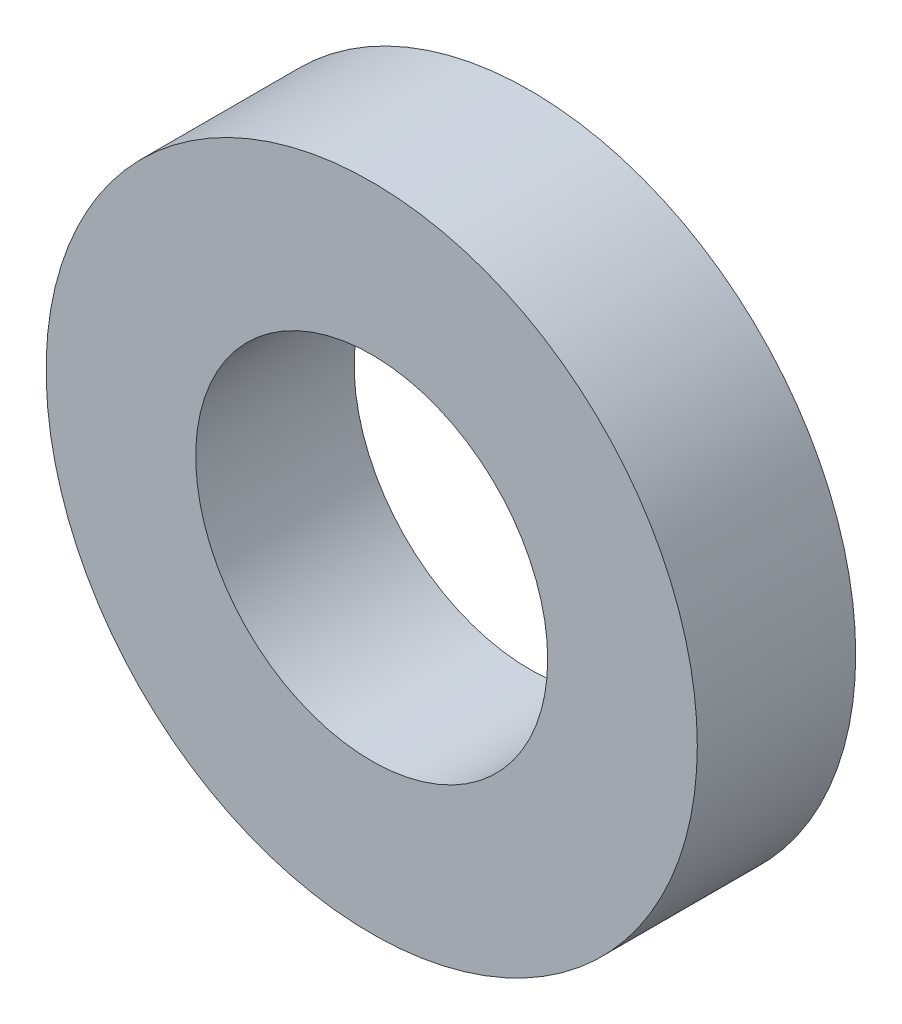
ISO-10303-21;
HEADER;
FILE_DESCRIPTION(('STEP AP214'),'2;1');
FILE_NAME('part.step','',(''),(''),'','','');
FILE_SCHEMA(('AUTOMOTIVE_DESIGN { 1 0 10303 214 1 1 1 1 }'));
ENDSEC;
DATA;
#1=APPLICATION_CONTEXT('core data for automotive mechanical design processes');
#2=APPLICATION_PROTOCOL_DEFINITION('international standard','automotive_design',2000,#1);
#3=PRODUCT_CONTEXT('',#1,'mechanical');
#4=PRODUCT('Part','Part','',(#3));
#5=PRODUCT_RELATED_PRODUCT_CATEGORY('part','',(#4));
#6=PRODUCT_DEFINITION_FORMATION('','',#4);
#7=PRODUCT_DEFINITION_CONTEXT('part definition',#1,'design');
#8=PRODUCT_DEFINITION('design','',#6,#7);
#9=PRODUCT_DEFINITION_SHAPE('','',#8);
#10=(LENGTH_UNIT() NAMED_UNIT(*) SI_UNIT(.MILLI.,.METRE.));
#11=(NAMED_UNIT(*) PLANE_ANGLE_UNIT() SI_UNIT($,.RADIAN.));
#12=(NAMED_UNIT(*) SI_UNIT($,.STERADIAN.) SOLID_ANGLE_UNIT());
#13=UNCERTAINTY_MEASURE_WITH_UNIT(LENGTH_MEASURE(1.E-05),#10,'distance_accuracy_value','');
#14=(GEOMETRIC_REPRESENTATION_CONTEXT(3) GLOBAL_UNCERTAINTY_ASSIGNED_CONTEXT((#13)) GLOBAL_UNIT_ASSIGNED_CONTEXT((#10,
#11,#12)) REPRESENTATION_CONTEXT('',''));
#15=CARTESIAN_POINT('',(0.,0.,0.));
#16=DIRECTION('',(0.,0.,1.));
#17=DIRECTION('',(1.,0.,0.));
#18=AXIS2_PLACEMENT_3D('',#15,#16,#17);
#19=CARTESIAN_POINT('',(0.,0.,9.));
#20=DIRECTION('',(0.,0.,1.));
#21=DIRECTION('',(1.,0.,0.));
#22=AXIS2_PLACEMENT_3D('',#19,#20,#21);
#23=PLANE('',#22);
#24=CARTESIAN_POINT('',(0.,0.,9.));
#25=DIRECTION('',(0.,0.,1.));
#26=DIRECTION('',(1.,0.,0.));
#27=AXIS2_PLACEMENT_3D('',#24,#25,#26);
#28=CIRCLE('',#27,18.5);
#29=CARTESIAN_POINT('',(18.5,0.,9.));
#30=VERTEX_POINT('',#29);
#31=EDGE_CURVE('E10',#30,#30,#28,.T.);
#32=ORIENTED_EDGE('',*,*,#31,.T.);
#33=EDGE_LOOP('',(#32));
#34=FACE_BOUND('',#33,.T.);
#35=CARTESIAN_POINT('',(0.,0.,9.));
#36=DIRECTION('',(0.,0.,1.));
#37=DIRECTION('',(1.,0.,0.));
#38=AXIS2_PLACEMENT_3D('',#35,#36,#37);
#39=CIRCLE('',#38,10.);
#40=CARTESIAN_POINT('',(10.,0.,9.));
#41=VERTEX_POINT('',#40);
#42=EDGE_CURVE('E50',#41,#41,#39,.T.);
#43=ORIENTED_EDGE('',*,*,#42,.F.);
#44=EDGE_LOOP('',(#43));
#45=FACE_BOUND('',#44,.T.);
#46=ADVANCED_FACE('F37',(#34,#45),#23,.T.);
#47=CARTESIAN_POINT('',(0.,0.,0.));
#48=DIRECTION('',(0.,0.,1.));
#49=DIRECTION('',(1.,0.,0.));
#50=AXIS2_PLACEMENT_3D('',#47,#48,#49);
#51=PLANE('',#50);
#52=CARTESIAN_POINT('',(0.,0.,0.));
#53=DIRECTION('',(0.,0.,1.));
#54=DIRECTION('',(1.,0.,0.));
#55=AXIS2_PLACEMENT_3D('',#52,#53,#54);
#56=CIRCLE('',#55,18.5);
#57=CARTESIAN_POINT('',(18.5,0.,0.));
#58=VERTEX_POINT('',#57);
#59=EDGE_CURVE('E41',#58,#58,#56,.T.);
#60=ORIENTED_EDGE('',*,*,#59,.F.);
#61=EDGE_LOOP('',(#60));
#62=FACE_BOUND('',#61,.T.);
#63=CARTESIAN_POINT('',(0.,0.,0.));
#64=DIRECTION('',(0.,0.,1.));
#65=DIRECTION('',(1.,0.,0.));
#66=AXIS2_PLACEMENT_3D('',#63,#64,#65);
#67=CIRCLE('',#66,10.);
#68=CARTESIAN_POINT('',(10.,0.,0.));
#69=VERTEX_POINT('',#68);
#70=EDGE_CURVE('E52',#69,#69,#67,.T.);
#71=ORIENTED_EDGE('',*,*,#70,.T.);
#72=EDGE_LOOP('',(#71));
#73=FACE_BOUND('',#72,.T.);
#74=ADVANCED_FACE('F64',(#62,#73),#51,.F.);
#75=CARTESIAN_POINT('',(0.,0.,9.));
#76=DIRECTION('',(0.,0.,-1.));
#77=DIRECTION('',(-1.,0.,0.));
#78=AXIS2_PLACEMENT_3D('',#75,#76,#77);
#79=CYLINDRICAL_SURFACE('',#78,18.5);
#80=ORIENTED_EDGE('',*,*,#31,.F.);
#81=EDGE_LOOP('',(#80));
#82=FACE_BOUND('',#81,.T.);
#83=ORIENTED_EDGE('',*,*,#59,.T.);
#84=EDGE_LOOP('',(#83));
#85=FACE_BOUND('',#84,.T.);
#86=ADVANCED_FACE('F39',(#82,#85),#79,.T.);
#87=CARTESIAN_POINT('',(0.,0.,9.));
#88=DIRECTION('',(0.,0.,-1.));
#89=DIRECTION('',(-1.,0.,0.));
#90=AXIS2_PLACEMENT_3D('',#87,#88,#89);
#91=CYLINDRICAL_SURFACE('',#90,10.);
#92=ORIENTED_EDGE('',*,*,#42,.T.);
#93=EDGE_LOOP('',(#92));
#94=FACE_BOUND('',#93,.T.);
#95=ORIENTED_EDGE('',*,*,#70,.F.);
#96=EDGE_LOOP('',(#95));
#97=FACE_BOUND('',#96,.T.);
#98=ADVANCED_FACE('F60',(#94,#97),#91,.F.);
#99=CLOSED_SHELL('',(#46,#74,#86,#98));
#100=MANIFOLD_SOLID_BREP('B2',#99);
#101=ADVANCED_BREP_SHAPE_REPRESENTATION('',(#18,#100),#14);
#102=SHAPE_DEFINITION_REPRESENTATION(#9,#101);
ENDSEC;
END-ISO-10303-21;
